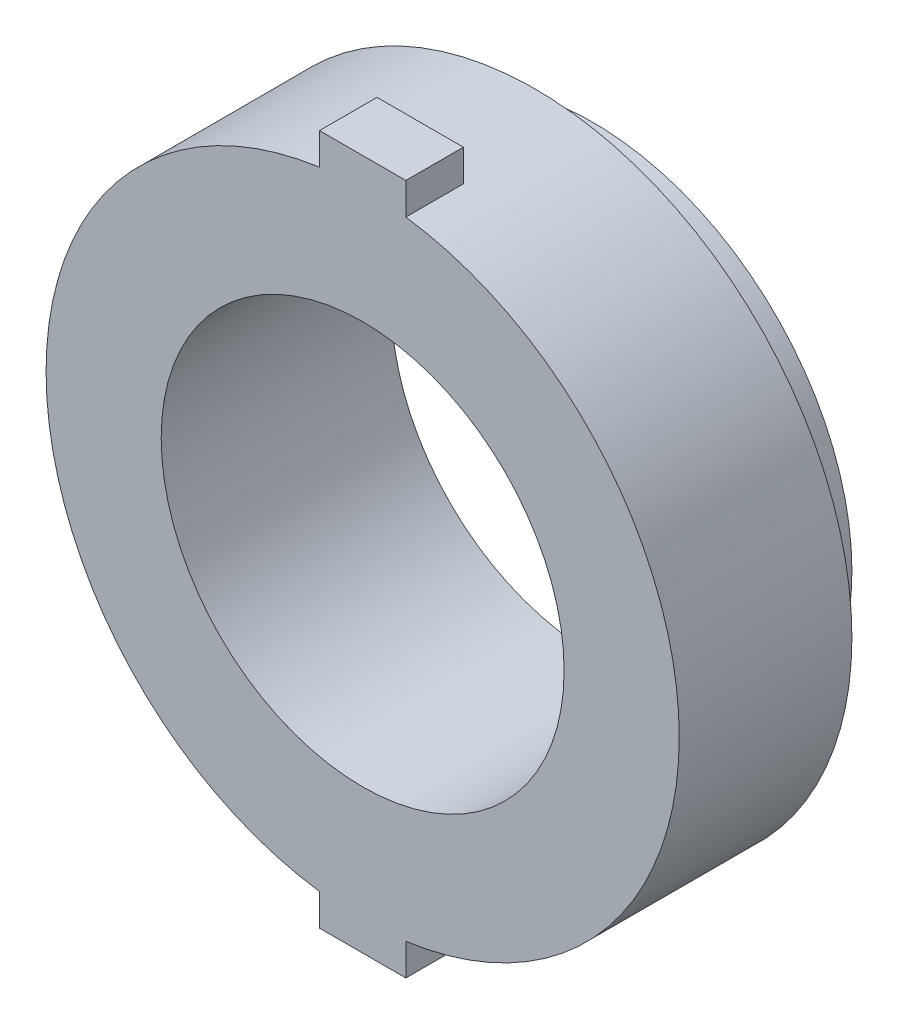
from build123d import *
from build123d.topology import SkipClean

# Parameters (mm, degrees)
ESQUISSE1_R          = 5.5
ESQUISSE1_R_2        = 3.5
BASE_EXTRUSION_DEPTH = 3
ESQUISSE2_W          = 1.5
ESQUISSE2_H          = 1.52796307
ESQUISSE2_H_2        = 1.743482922
BOSS_EXTRU_1_DEPTH   = 1
BOSS_EXTRU_2_START   = 1
ESQUISSE3_R          = 4.5
ESQUISSE3_R_2        = 3.5
BOSS_EXTRU_2_DEPTH   = 1


with BuildPart() as part:
    # Esquisse1 → Base-Extrusion (new body)
    with BuildSketch(Plane.XY):
        Circle(ESQUISSE1_R)
        Circle(ESQUISSE1_R_2, mode=Mode.SUBTRACT)
    extrude(amount=BASE_EXTRUSION_DEPTH)

    # Esquisse2 → Boss.-Extru.1 (add)
    with BuildSketch(Plane.XY.offset(3)):
        with Locations((0, 5.236018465)):
            Rectangle(ESQUISSE2_W, ESQUISSE2_H)
        with Locations((0, -5.128258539)):
            Rectangle(ESQUISSE2_W, ESQUISSE2_H_2)
    extrude(amount=-BOSS_EXTRU_1_DEPTH)

    # Esquisse3 → Boss.-Extru.2 (add)
    with SkipClean():  # the faces are left unmerged after this step: merging them gives an invalid solid
        with BuildSketch(Plane(origin=(0, 0, 0), x_dir=(-1, 0, 0), z_dir=(0, 0, -1)).offset(BOSS_EXTRU_2_START)):
            with Locations(Location((0, 0, 0), (0, 0, 180))):
                Circle(ESQUISSE3_R)
            Circle(ESQUISSE3_R_2, mode=Mode.SUBTRACT)
        extrude(amount=-BOSS_EXTRU_2_DEPTH)


solid = part.part
